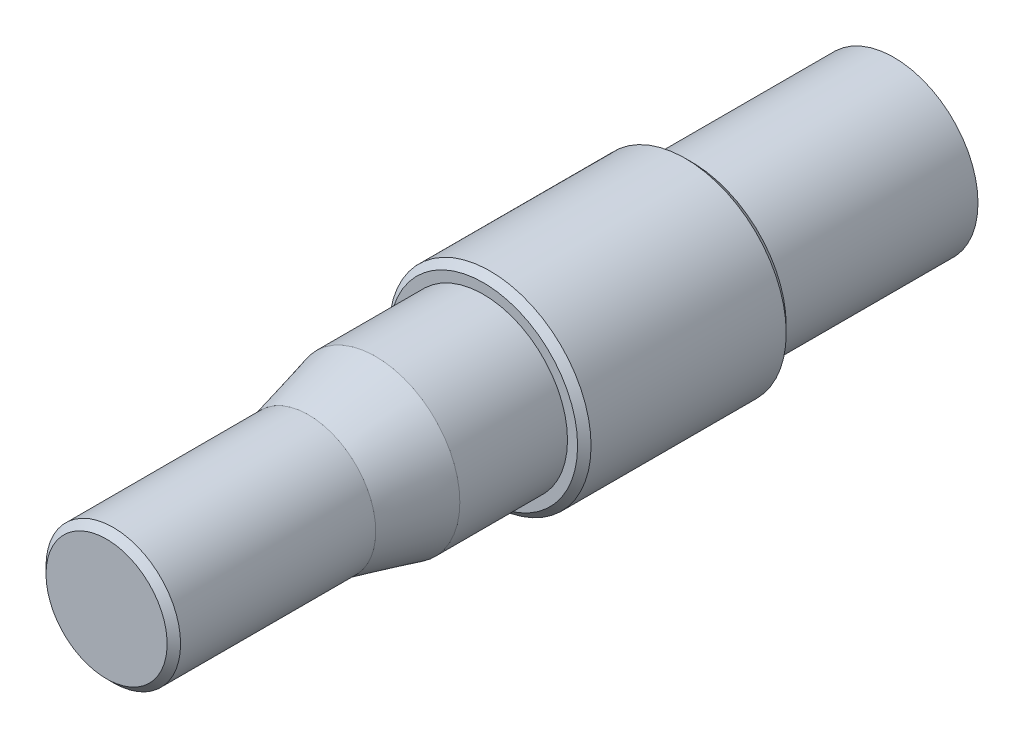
ISO-10303-21;
HEADER;
FILE_DESCRIPTION(('STEP AP214'),'2;1');
FILE_NAME('part.step','',(''),(''),'','','');
FILE_SCHEMA(('AUTOMOTIVE_DESIGN { 1 0 10303 214 1 1 1 1 }'));
ENDSEC;
DATA;
#1=APPLICATION_CONTEXT('core data for automotive mechanical design processes');
#2=APPLICATION_PROTOCOL_DEFINITION('international standard','automotive_design',2000,#1);
#3=PRODUCT_CONTEXT('',#1,'mechanical');
#4=PRODUCT('Part','Part','',(#3));
#5=PRODUCT_RELATED_PRODUCT_CATEGORY('part','',(#4));
#6=PRODUCT_DEFINITION_FORMATION('','',#4);
#7=PRODUCT_DEFINITION_CONTEXT('part definition',#1,'design');
#8=PRODUCT_DEFINITION('design','',#6,#7);
#9=PRODUCT_DEFINITION_SHAPE('','',#8);
#10=(LENGTH_UNIT() NAMED_UNIT(*) SI_UNIT(.MILLI.,.METRE.));
#11=(NAMED_UNIT(*) PLANE_ANGLE_UNIT() SI_UNIT($,.RADIAN.));
#12=(NAMED_UNIT(*) SI_UNIT($,.STERADIAN.) SOLID_ANGLE_UNIT());
#13=UNCERTAINTY_MEASURE_WITH_UNIT(LENGTH_MEASURE(1.E-05),#10,'distance_accuracy_value','');
#14=(GEOMETRIC_REPRESENTATION_CONTEXT(3) GLOBAL_UNCERTAINTY_ASSIGNED_CONTEXT((#13)) GLOBAL_UNIT_ASSIGNED_CONTEXT((#10,
#11,#12)) REPRESENTATION_CONTEXT('',''));
#15=CARTESIAN_POINT('',(0.,0.,0.));
#16=DIRECTION('',(0.,0.,1.));
#17=DIRECTION('',(1.,0.,0.));
#18=AXIS2_PLACEMENT_3D('',#15,#16,#17);
#19=CARTESIAN_POINT('',(0.,0.,31.));
#20=DIRECTION('',(0.,0.,1.));
#21=DIRECTION('',(1.,0.,0.));
#22=AXIS2_PLACEMENT_3D('',#19,#20,#21);
#23=PLANE('',#22);
#24=CARTESIAN_POINT('',(0.,0.,31.));
#25=DIRECTION('',(0.,0.,1.));
#26=DIRECTION('',(1.,0.,0.));
#27=AXIS2_PLACEMENT_3D('',#24,#25,#26);
#28=CIRCLE('',#27,14.);
#29=CARTESIAN_POINT('',(14.,0.,31.));
#30=VERTEX_POINT('',#29);
#31=EDGE_CURVE('E42',#30,#30,#28,.T.);
#32=ORIENTED_EDGE('',*,*,#31,.T.);
#33=EDGE_LOOP('',(#32));
#34=FACE_BOUND('',#33,.T.);
#35=CARTESIAN_POINT('',(0.,0.,31.));
#36=DIRECTION('',(0.,0.,1.));
#37=DIRECTION('',(1.,0.,0.));
#38=AXIS2_PLACEMENT_3D('',#35,#36,#37);
#39=CIRCLE('',#38,12.5);
#40=CARTESIAN_POINT('',(12.5,0.,31.));
#41=VERTEX_POINT('',#40);
#42=EDGE_CURVE('E66',#41,#41,#39,.T.);
#43=ORIENTED_EDGE('',*,*,#42,.F.);
#44=EDGE_LOOP('',(#43));
#45=FACE_BOUND('',#44,.T.);
#46=ADVANCED_FACE('F31',(#34,#45),#23,.T.);
#47=CARTESIAN_POINT('',(0.,0.,-30.));
#48=DIRECTION('',(0.,0.,1.));
#49=DIRECTION('',(1.,0.,0.));
#50=AXIS2_PLACEMENT_3D('',#47,#48,#49);
#51=CYLINDRICAL_SURFACE('',#50,12.5);
#52=CARTESIAN_POINT('',(0.,0.,-30.));
#53=DIRECTION('',(0.,0.,1.));
#54=DIRECTION('',(1.,0.,0.));
#55=AXIS2_PLACEMENT_3D('',#52,#53,#54);
#56=CIRCLE('',#55,12.5);
#57=CARTESIAN_POINT('',(12.5,0.,-30.));
#58=VERTEX_POINT('',#57);
#59=EDGE_CURVE('E57',#58,#58,#56,.T.);
#60=ORIENTED_EDGE('',*,*,#59,.T.);
#61=EDGE_LOOP('',(#60));
#62=FACE_BOUND('',#61,.T.);
#63=CARTESIAN_POINT('',(0.,0.,0.));
#64=DIRECTION('',(0.,0.,1.));
#65=DIRECTION('',(1.,0.,0.));
#66=AXIS2_PLACEMENT_3D('',#63,#64,#65);
#67=CIRCLE('',#66,12.5);
#68=CARTESIAN_POINT('',(12.5,0.,0.));
#69=VERTEX_POINT('',#68);
#70=EDGE_CURVE('E60',#69,#69,#67,.T.);
#71=ORIENTED_EDGE('',*,*,#70,.F.);
#72=EDGE_LOOP('',(#71));
#73=FACE_BOUND('',#72,.T.);
#74=ADVANCED_FACE('F33',(#62,#73),#51,.T.);
#75=CARTESIAN_POINT('',(0.,0.,-30.));
#76=DIRECTION('',(0.,0.,1.));
#77=DIRECTION('',(1.,0.,0.));
#78=AXIS2_PLACEMENT_3D('',#75,#76,#77);
#79=PLANE('',#78);
#80=ORIENTED_EDGE('',*,*,#59,.F.);
#81=EDGE_LOOP('',(#80));
#82=FACE_BOUND('',#81,.T.);
#83=ADVANCED_FACE('F96',(#82),#79,.F.);
#84=CARTESIAN_POINT('',(0.,0.,31.));
#85=DIRECTION('',(0.,0.,-1.));
#86=DIRECTION('',(-1.,0.,0.));
#87=AXIS2_PLACEMENT_3D('',#84,#85,#86);
#88=CYLINDRICAL_SURFACE('',#87,15.);
#89=CARTESIAN_POINT('',(0.,0.,1.));
#90=DIRECTION('',(0.,0.,1.));
#91=DIRECTION('',(1.,0.,0.));
#92=AXIS2_PLACEMENT_3D('',#89,#90,#91);
#93=CIRCLE('',#92,15.);
#94=CARTESIAN_POINT('',(15.,0.,1.));
#95=VERTEX_POINT('',#94);
#96=EDGE_CURVE('E51',#95,#95,#93,.T.);
#97=ORIENTED_EDGE('',*,*,#96,.T.);
#98=EDGE_LOOP('',(#97));
#99=FACE_BOUND('',#98,.T.);
#100=CARTESIAN_POINT('',(0.,0.,30.));
#101=DIRECTION('',(0.,0.,1.));
#102=DIRECTION('',(1.,0.,0.));
#103=AXIS2_PLACEMENT_3D('',#100,#101,#102);
#104=CIRCLE('',#103,15.);
#105=CARTESIAN_POINT('',(15.,0.,30.));
#106=VERTEX_POINT('',#105);
#107=EDGE_CURVE('E54',#106,#106,#104,.F.);
#108=ORIENTED_EDGE('',*,*,#107,.T.);
#109=EDGE_LOOP('',(#108));
#110=FACE_BOUND('',#109,.T.);
#111=ADVANCED_FACE('F102',(#99,#110),#88,.T.);
#112=CARTESIAN_POINT('',(0.,0.,0.));
#113=DIRECTION('',(0.,0.,1.));
#114=DIRECTION('',(1.,0.,0.));
#115=AXIS2_PLACEMENT_3D('',#112,#113,#114);
#116=PLANE('',#115);
#117=CARTESIAN_POINT('',(0.,0.,0.));
#118=DIRECTION('',(0.,0.,1.));
#119=DIRECTION('',(1.,0.,0.));
#120=AXIS2_PLACEMENT_3D('',#117,#118,#119);
#121=CIRCLE('',#120,14.);
#122=CARTESIAN_POINT('',(14.,0.,0.));
#123=VERTEX_POINT('',#122);
#124=EDGE_CURVE('E46',#123,#123,#121,.F.);
#125=ORIENTED_EDGE('',*,*,#124,.T.);
#126=EDGE_LOOP('',(#125));
#127=FACE_BOUND('',#126,.T.);
#128=ORIENTED_EDGE('',*,*,#70,.T.);
#129=EDGE_LOOP('',(#128));
#130=FACE_BOUND('',#129,.T.);
#131=ADVANCED_FACE('F100',(#127,#130),#116,.F.);
#132=CARTESIAN_POINT('',(0.,0.,1.));
#133=DIRECTION('',(0.,0.,1.));
#134=DIRECTION('',(1.,0.,0.));
#135=AXIS2_PLACEMENT_3D('',#132,#133,#134);
#136=CONICAL_SURFACE('',#135,15.,0.785398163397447);
#137=ORIENTED_EDGE('',*,*,#124,.F.);
#138=EDGE_LOOP('',(#137));
#139=FACE_BOUND('',#138,.T.);
#140=ORIENTED_EDGE('',*,*,#96,.F.);
#141=EDGE_LOOP('',(#140));
#142=FACE_BOUND('',#141,.T.);
#143=ADVANCED_FACE('F114',(#139,#142),#136,.T.);
#144=CARTESIAN_POINT('',(0.,0.,31.));
#145=DIRECTION('',(0.,0.,-1.));
#146=DIRECTION('',(-1.,0.,0.));
#147=AXIS2_PLACEMENT_3D('',#144,#145,#146);
#148=CONICAL_SURFACE('',#147,14.,0.785398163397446);
#149=ORIENTED_EDGE('',*,*,#107,.F.);
#150=EDGE_LOOP('',(#149));
#151=FACE_BOUND('',#150,.T.);
#152=ORIENTED_EDGE('',*,*,#31,.F.);
#153=EDGE_LOOP('',(#152));
#154=FACE_BOUND('',#153,.T.);
#155=ADVANCED_FACE('F86',(#151,#154),#148,.T.);
#156=CARTESIAN_POINT('',(0.,0.,47.));
#157=DIRECTION('',(0.,0.,-1.));
#158=DIRECTION('',(-1.,0.,0.));
#159=AXIS2_PLACEMENT_3D('',#156,#157,#158);
#160=CYLINDRICAL_SURFACE('',#159,12.5);
#161=CARTESIAN_POINT('',(0.,0.,47.));
#162=DIRECTION('',(0.,0.,1.));
#163=DIRECTION('',(1.,0.,0.));
#164=AXIS2_PLACEMENT_3D('',#161,#162,#163);
#165=CIRCLE('',#164,12.5);
#166=CARTESIAN_POINT('',(12.5,0.,47.));
#167=VERTEX_POINT('',#166);
#168=EDGE_CURVE('E63',#167,#167,#165,.T.);
#169=ORIENTED_EDGE('',*,*,#168,.F.);
#170=EDGE_LOOP('',(#169));
#171=FACE_BOUND('',#170,.T.);
#172=ORIENTED_EDGE('',*,*,#42,.T.);
#173=EDGE_LOOP('',(#172));
#174=FACE_BOUND('',#173,.T.);
#175=ADVANCED_FACE('F82',(#171,#174),#160,.T.);
#176=CARTESIAN_POINT('',(0.,9.99999999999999,87.));
#177=DIRECTION('',(0.,0.,-1.));
#178=DIRECTION('',(-1.,0.,0.));
#179=AXIS2_PLACEMENT_3D('',#176,#177,#178);
#180=PLANE('',#179);
#181=CARTESIAN_POINT('',(0.,0.,87.));
#182=DIRECTION('',(0.,0.,-1.));
#183=DIRECTION('',(-1.,0.,0.));
#184=AXIS2_PLACEMENT_3D('',#181,#182,#183);
#185=CIRCLE('',#184,8.99999999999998);
#186=CARTESIAN_POINT('',(-8.99999999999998,0.,87.));
#187=VERTEX_POINT('',#186);
#188=EDGE_CURVE('E38',#187,#187,#185,.F.);
#189=ORIENTED_EDGE('',*,*,#188,.T.);
#190=EDGE_LOOP('',(#189));
#191=FACE_BOUND('',#190,.T.);
#192=ADVANCED_FACE('F85',(#191),#180,.F.);
#193=CARTESIAN_POINT('',(0.,0.,47.));
#194=DIRECTION('',(0.,0.,1.));
#195=DIRECTION('',(1.,0.,0.));
#196=AXIS2_PLACEMENT_3D('',#193,#194,#195);
#197=CYLINDRICAL_SURFACE('',#196,10.);
#198=CARTESIAN_POINT('',(0.,0.,86.));
#199=DIRECTION('',(0.,0.,-1.));
#200=DIRECTION('',(-1.,0.,0.));
#201=AXIS2_PLACEMENT_3D('',#198,#199,#200);
#202=CIRCLE('',#201,10.);
#203=CARTESIAN_POINT('',(-10.,0.,86.));
#204=VERTEX_POINT('',#203);
#205=EDGE_CURVE('E10',#204,#204,#202,.T.);
#206=ORIENTED_EDGE('',*,*,#205,.T.);
#207=EDGE_LOOP('',(#206));
#208=FACE_BOUND('',#207,.T.);
#209=CARTESIAN_POINT('',(0.,0.,57.));
#210=DIRECTION('',(0.,0.,1.));
#211=DIRECTION('',(1.,0.,0.));
#212=AXIS2_PLACEMENT_3D('',#209,#210,#211);
#213=CIRCLE('',#212,10.);
#214=CARTESIAN_POINT('',(10.,0.,57.));
#215=VERTEX_POINT('',#214);
#216=EDGE_CURVE('E69',#215,#215,#213,.T.);
#217=ORIENTED_EDGE('',*,*,#216,.T.);
#218=EDGE_LOOP('',(#217));
#219=FACE_BOUND('',#218,.T.);
#220=ADVANCED_FACE('F73',(#208,#219),#197,.T.);
#221=CARTESIAN_POINT('',(0.,0.,47.));
#222=DIRECTION('',(0.,0.,-1.));
#223=DIRECTION('',(-1.,0.,0.));
#224=AXIS2_PLACEMENT_3D('',#221,#222,#223);
#225=CONICAL_SURFACE('',#224,12.5,0.244978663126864);
#226=ORIENTED_EDGE('',*,*,#216,.F.);
#227=EDGE_LOOP('',(#226));
#228=FACE_BOUND('',#227,.T.);
#229=ORIENTED_EDGE('',*,*,#168,.T.);
#230=EDGE_LOOP('',(#229));
#231=FACE_BOUND('',#230,.T.);
#232=ADVANCED_FACE('F75',(#228,#231),#225,.T.);
#233=CARTESIAN_POINT('',(0.,0.,87.));
#234=DIRECTION('',(0.,0.,-1.));
#235=DIRECTION('',(-1.,0.,0.));
#236=AXIS2_PLACEMENT_3D('',#233,#234,#235);
#237=CONICAL_SURFACE('',#236,8.99999999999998,0.78539816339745);
#238=ORIENTED_EDGE('',*,*,#205,.F.);
#239=EDGE_LOOP('',(#238));
#240=FACE_BOUND('',#239,.T.);
#241=ORIENTED_EDGE('',*,*,#188,.F.);
#242=EDGE_LOOP('',(#241));
#243=FACE_BOUND('',#242,.T.);
#244=ADVANCED_FACE('F78',(#240,#243),#237,.T.);
#245=CLOSED_SHELL('',(#46,#74,#83,#111,#131,#143,#155,#175,#192,#220,#232,#244));
#246=MANIFOLD_SOLID_BREP('B2',#245);
#247=ADVANCED_BREP_SHAPE_REPRESENTATION('',(#18,#246),#14);
#248=SHAPE_DEFINITION_REPRESENTATION(#9,#247);
ENDSEC;
END-ISO-10303-21;
